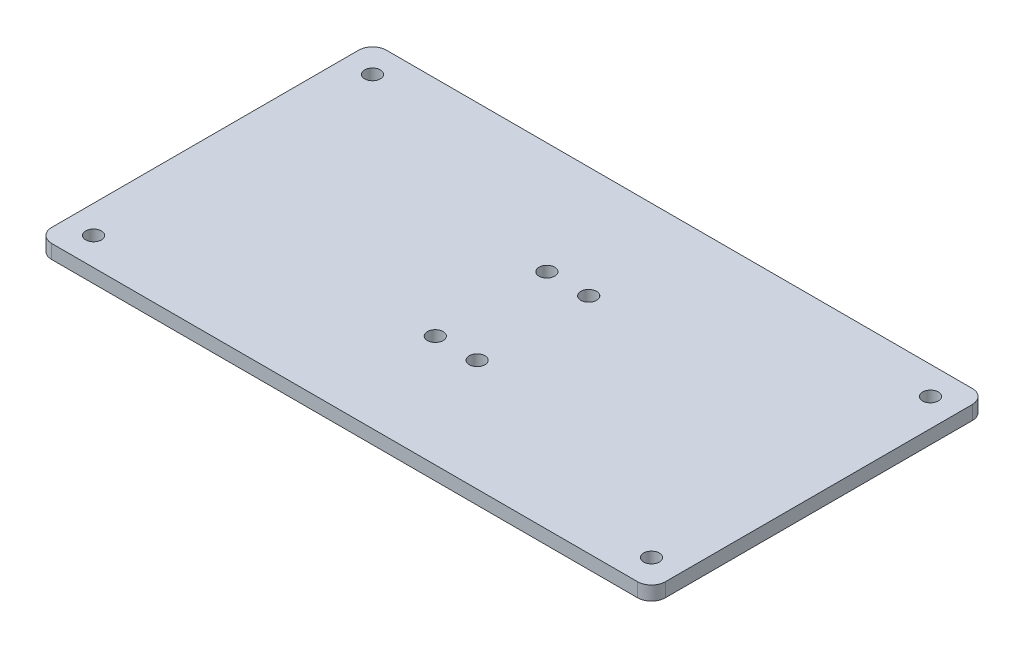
ISO-10303-21;
HEADER;
FILE_DESCRIPTION(('STEP AP214'),'2;1');
FILE_NAME('part.step','',(''),(''),'','','');
FILE_SCHEMA(('AUTOMOTIVE_DESIGN { 1 0 10303 214 1 1 1 1 }'));
ENDSEC;
DATA;
#1=APPLICATION_CONTEXT('core data for automotive mechanical design processes');
#2=APPLICATION_PROTOCOL_DEFINITION('international standard','automotive_design',2000,#1);
#3=PRODUCT_CONTEXT('',#1,'mechanical');
#4=PRODUCT('Part','Part','',(#3));
#5=PRODUCT_RELATED_PRODUCT_CATEGORY('part','',(#4));
#6=PRODUCT_DEFINITION_FORMATION('','',#4);
#7=PRODUCT_DEFINITION_CONTEXT('part definition',#1,'design');
#8=PRODUCT_DEFINITION('design','',#6,#7);
#9=PRODUCT_DEFINITION_SHAPE('','',#8);
#10=(LENGTH_UNIT() NAMED_UNIT(*) SI_UNIT(.MILLI.,.METRE.));
#11=(NAMED_UNIT(*) PLANE_ANGLE_UNIT() SI_UNIT($,.RADIAN.));
#12=(NAMED_UNIT(*) SI_UNIT($,.STERADIAN.) SOLID_ANGLE_UNIT());
#13=UNCERTAINTY_MEASURE_WITH_UNIT(LENGTH_MEASURE(1.E-05),#10,'distance_accuracy_value','');
#14=(GEOMETRIC_REPRESENTATION_CONTEXT(3) GLOBAL_UNCERTAINTY_ASSIGNED_CONTEXT((#13)) GLOBAL_UNIT_ASSIGNED_CONTEXT((#10,
#11,#12)) REPRESENTATION_CONTEXT('',''));
#15=CARTESIAN_POINT('',(0.,0.,0.));
#16=DIRECTION('',(0.,0.,1.));
#17=DIRECTION('',(1.,0.,0.));
#18=AXIS2_PLACEMENT_3D('',#15,#16,#17);
#19=CARTESIAN_POINT('',(0.,6.35,0.));
#20=DIRECTION('',(0.,-1.,0.));
#21=DIRECTION('',(0.,0.,-1.));
#22=AXIS2_PLACEMENT_3D('',#19,#20,#21);
#23=PLANE('',#22);
#24=DIRECTION('',(0.,0.,-1.));
#25=VECTOR('',#24,1.);
#26=CARTESIAN_POINT('',(139.7,6.35,76.2));
#27=LINE('',#26,#25);
#28=CARTESIAN_POINT('',(139.7,6.35,69.85));
#29=VERTEX_POINT('',#28);
#30=CARTESIAN_POINT('',(139.7,6.35,-69.85));
#31=VERTEX_POINT('',#30);
#32=EDGE_CURVE('E152',#29,#31,#27,.T.);
#33=ORIENTED_EDGE('',*,*,#32,.T.);
#34=CARTESIAN_POINT('',(133.35,6.35,-69.85));
#35=DIRECTION('',(0.,-1.,0.));
#36=DIRECTION('',(0.,0.,-1.));
#37=AXIS2_PLACEMENT_3D('',#34,#35,#36);
#38=CIRCLE('',#37,6.35);
#39=CARTESIAN_POINT('',(133.35,6.35,-76.2));
#40=VERTEX_POINT('',#39);
#41=EDGE_CURVE('E175',#31,#40,#38,.F.);
#42=ORIENTED_EDGE('',*,*,#41,.T.);
#43=DIRECTION('',(-1.,0.,0.));
#44=VECTOR('',#43,1.);
#45=CARTESIAN_POINT('',(-139.7,6.35,-76.2));
#46=LINE('',#45,#44);
#47=CARTESIAN_POINT('',(-133.35,6.35,-76.2));
#48=VERTEX_POINT('',#47);
#49=EDGE_CURVE('E128',#40,#48,#46,.T.);
#50=ORIENTED_EDGE('',*,*,#49,.T.);
#51=CARTESIAN_POINT('',(-133.35,6.35,-69.85));
#52=DIRECTION('',(0.,-1.,0.));
#53=DIRECTION('',(0.,0.,-1.));
#54=AXIS2_PLACEMENT_3D('',#51,#52,#53);
#55=CIRCLE('',#54,6.35);
#56=CARTESIAN_POINT('',(-139.7,6.35,-69.85));
#57=VERTEX_POINT('',#56);
#58=EDGE_CURVE('E169',#48,#57,#55,.F.);
#59=ORIENTED_EDGE('',*,*,#58,.T.);
#60=DIRECTION('',(0.,0.,1.));
#61=VECTOR('',#60,1.);
#62=CARTESIAN_POINT('',(-139.7,6.35,76.2));
#63=LINE('',#62,#61);
#64=CARTESIAN_POINT('',(-139.7,6.35,69.85));
#65=VERTEX_POINT('',#64);
#66=EDGE_CURVE('E188',#57,#65,#63,.T.);
#67=ORIENTED_EDGE('',*,*,#66,.T.);
#68=CARTESIAN_POINT('',(-133.35,6.35,69.85));
#69=DIRECTION('',(0.,-1.,0.));
#70=DIRECTION('',(0.,0.,-1.));
#71=AXIS2_PLACEMENT_3D('',#68,#69,#70);
#72=CIRCLE('',#71,6.35);
#73=CARTESIAN_POINT('',(-133.35,6.35,76.2));
#74=VERTEX_POINT('',#73);
#75=EDGE_CURVE('E62',#65,#74,#72,.F.);
#76=ORIENTED_EDGE('',*,*,#75,.T.);
#77=DIRECTION('',(1.,0.,0.));
#78=VECTOR('',#77,1.);
#79=CARTESIAN_POINT('',(-139.7,6.35,76.2));
#80=LINE('',#79,#78);
#81=CARTESIAN_POINT('',(133.35,6.35,76.2));
#82=VERTEX_POINT('',#81);
#83=EDGE_CURVE('E154',#74,#82,#80,.T.);
#84=ORIENTED_EDGE('',*,*,#83,.T.);
#85=CARTESIAN_POINT('',(133.35,6.35,69.85));
#86=DIRECTION('',(0.,-1.,0.));
#87=DIRECTION('',(0.,0.,-1.));
#88=AXIS2_PLACEMENT_3D('',#85,#86,#87);
#89=CIRCLE('',#88,6.35);
#90=EDGE_CURVE('E172',#82,#29,#89,.F.);
#91=ORIENTED_EDGE('',*,*,#90,.T.);
#92=EDGE_LOOP('',(#33,#42,#50,#59,#67,#76,#84,#91));
#93=FACE_BOUND('',#92,.T.);
#94=CARTESIAN_POINT('',(9.52500000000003,6.35,-25.4));
#95=DIRECTION('',(0.,1.,0.));
#96=DIRECTION('',(0.,0.,1.));
#97=AXIS2_PLACEMENT_3D('',#94,#95,#96);
#98=CIRCLE('',#97,3.571875);
#99=CARTESIAN_POINT('',(9.52500000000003,6.35,-21.828125));
#100=VERTEX_POINT('',#99);
#101=EDGE_CURVE('E146',#100,#100,#98,.T.);
#102=ORIENTED_EDGE('',*,*,#101,.F.);
#103=EDGE_LOOP('',(#102));
#104=FACE_BOUND('',#103,.T.);
#105=CARTESIAN_POINT('',(-9.52499999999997,6.35,-25.4));
#106=DIRECTION('',(0.,1.,0.));
#107=DIRECTION('',(0.,0.,1.));
#108=AXIS2_PLACEMENT_3D('',#105,#106,#107);
#109=CIRCLE('',#108,3.571875);
#110=CARTESIAN_POINT('',(-9.52499999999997,6.35,-21.828125));
#111=VERTEX_POINT('',#110);
#112=EDGE_CURVE('E216',#111,#111,#109,.T.);
#113=ORIENTED_EDGE('',*,*,#112,.F.);
#114=EDGE_LOOP('',(#113));
#115=FACE_BOUND('',#114,.T.);
#116=CARTESIAN_POINT('',(-9.52499999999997,6.35,25.4));
#117=DIRECTION('',(0.,1.,0.));
#118=DIRECTION('',(0.,0.,1.));
#119=AXIS2_PLACEMENT_3D('',#116,#117,#118);
#120=CIRCLE('',#119,3.571875);
#121=CARTESIAN_POINT('',(-9.52499999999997,6.35,28.971875));
#122=VERTEX_POINT('',#121);
#123=EDGE_CURVE('E224',#122,#122,#120,.T.);
#124=ORIENTED_EDGE('',*,*,#123,.F.);
#125=EDGE_LOOP('',(#124));
#126=FACE_BOUND('',#125,.T.);
#127=CARTESIAN_POINT('',(9.52500000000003,6.35,25.4));
#128=DIRECTION('',(0.,1.,0.));
#129=DIRECTION('',(0.,0.,1.));
#130=AXIS2_PLACEMENT_3D('',#127,#128,#129);
#131=CIRCLE('',#130,3.571875);
#132=CARTESIAN_POINT('',(9.52500000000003,6.35,28.971875));
#133=VERTEX_POINT('',#132);
#134=EDGE_CURVE('E232',#133,#133,#131,.T.);
#135=ORIENTED_EDGE('',*,*,#134,.F.);
#136=EDGE_LOOP('',(#135));
#137=FACE_BOUND('',#136,.T.);
#138=CARTESIAN_POINT('',(-127.,6.35,-63.5));
#139=DIRECTION('',(0.,1.,0.));
#140=DIRECTION('',(0.,0.,1.));
#141=AXIS2_PLACEMENT_3D('',#138,#139,#140);
#142=CIRCLE('',#141,3.57187500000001);
#143=CARTESIAN_POINT('',(-127.,6.35,-59.928125));
#144=VERTEX_POINT('',#143);
#145=EDGE_CURVE('E240',#144,#144,#142,.T.);
#146=ORIENTED_EDGE('',*,*,#145,.F.);
#147=EDGE_LOOP('',(#146));
#148=FACE_BOUND('',#147,.T.);
#149=CARTESIAN_POINT('',(127.,6.35,-63.5));
#150=DIRECTION('',(0.,1.,0.));
#151=DIRECTION('',(0.,0.,1.));
#152=AXIS2_PLACEMENT_3D('',#149,#150,#151);
#153=CIRCLE('',#152,3.57187500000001);
#154=CARTESIAN_POINT('',(127.,6.35,-59.928125));
#155=VERTEX_POINT('',#154);
#156=EDGE_CURVE('E248',#155,#155,#153,.T.);
#157=ORIENTED_EDGE('',*,*,#156,.F.);
#158=EDGE_LOOP('',(#157));
#159=FACE_BOUND('',#158,.T.);
#160=CARTESIAN_POINT('',(127.,6.35,63.5));
#161=DIRECTION('',(0.,1.,0.));
#162=DIRECTION('',(0.,0.,1.));
#163=AXIS2_PLACEMENT_3D('',#160,#161,#162);
#164=CIRCLE('',#163,3.57187500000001);
#165=CARTESIAN_POINT('',(127.,6.35,67.071875));
#166=VERTEX_POINT('',#165);
#167=EDGE_CURVE('E256',#166,#166,#164,.T.);
#168=ORIENTED_EDGE('',*,*,#167,.F.);
#169=EDGE_LOOP('',(#168));
#170=FACE_BOUND('',#169,.T.);
#171=CARTESIAN_POINT('',(-127.,6.35,63.5));
#172=DIRECTION('',(0.,1.,0.));
#173=DIRECTION('',(0.,0.,1.));
#174=AXIS2_PLACEMENT_3D('',#171,#172,#173);
#175=CIRCLE('',#174,3.57187500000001);
#176=CARTESIAN_POINT('',(-127.,6.35,67.071875));
#177=VERTEX_POINT('',#176);
#178=EDGE_CURVE('E264',#177,#177,#175,.T.);
#179=ORIENTED_EDGE('',*,*,#178,.F.);
#180=EDGE_LOOP('',(#179));
#181=FACE_BOUND('',#180,.T.);
#182=ADVANCED_FACE('F39',(#93,#104,#115,#126,#137,#148,#159,#170,#181),#23,.F.);
#183=CARTESIAN_POINT('',(0.,0.,0.));
#184=DIRECTION('',(0.,-1.,0.));
#185=DIRECTION('',(0.,0.,-1.));
#186=AXIS2_PLACEMENT_3D('',#183,#184,#185);
#187=PLANE('',#186);
#188=CARTESIAN_POINT('',(127.,0.,63.5));
#189=DIRECTION('',(0.,1.,0.));
#190=DIRECTION('',(0.,0.,1.));
#191=AXIS2_PLACEMENT_3D('',#188,#189,#190);
#192=CIRCLE('',#191,3.57187500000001);
#193=CARTESIAN_POINT('',(127.,0.,67.071875));
#194=VERTEX_POINT('',#193);
#195=EDGE_CURVE('E260',#194,#194,#192,.T.);
#196=ORIENTED_EDGE('',*,*,#195,.T.);
#197=EDGE_LOOP('',(#196));
#198=FACE_BOUND('',#197,.T.);
#199=CARTESIAN_POINT('',(-127.,0.,-63.5));
#200=DIRECTION('',(0.,1.,0.));
#201=DIRECTION('',(0.,0.,1.));
#202=AXIS2_PLACEMENT_3D('',#199,#200,#201);
#203=CIRCLE('',#202,3.57187500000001);
#204=CARTESIAN_POINT('',(-127.,0.,-59.928125));
#205=VERTEX_POINT('',#204);
#206=EDGE_CURVE('E244',#205,#205,#203,.T.);
#207=ORIENTED_EDGE('',*,*,#206,.T.);
#208=EDGE_LOOP('',(#207));
#209=FACE_BOUND('',#208,.T.);
#210=CARTESIAN_POINT('',(-9.52499999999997,0.,25.4));
#211=DIRECTION('',(0.,1.,0.));
#212=DIRECTION('',(0.,0.,1.));
#213=AXIS2_PLACEMENT_3D('',#210,#211,#212);
#214=CIRCLE('',#213,3.571875);
#215=CARTESIAN_POINT('',(-9.52499999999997,0.,28.971875));
#216=VERTEX_POINT('',#215);
#217=EDGE_CURVE('E228',#216,#216,#214,.T.);
#218=ORIENTED_EDGE('',*,*,#217,.T.);
#219=EDGE_LOOP('',(#218));
#220=FACE_BOUND('',#219,.T.);
#221=CARTESIAN_POINT('',(9.52500000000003,0.,-25.4));
#222=DIRECTION('',(0.,1.,0.));
#223=DIRECTION('',(0.,0.,1.));
#224=AXIS2_PLACEMENT_3D('',#221,#222,#223);
#225=CIRCLE('',#224,3.571875);
#226=CARTESIAN_POINT('',(9.52500000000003,0.,-21.828125));
#227=VERTEX_POINT('',#226);
#228=EDGE_CURVE('E211',#227,#227,#225,.T.);
#229=ORIENTED_EDGE('',*,*,#228,.T.);
#230=EDGE_LOOP('',(#229));
#231=FACE_BOUND('',#230,.T.);
#232=DIRECTION('',(-1.,0.,0.));
#233=VECTOR('',#232,1.);
#234=CARTESIAN_POINT('',(-139.7,0.,-76.2));
#235=LINE('',#234,#233);
#236=CARTESIAN_POINT('',(133.35,0.,-76.2));
#237=VERTEX_POINT('',#236);
#238=CARTESIAN_POINT('',(-133.35,0.,-76.2));
#239=VERTEX_POINT('',#238);
#240=EDGE_CURVE('E125',#237,#239,#235,.T.);
#241=ORIENTED_EDGE('',*,*,#240,.F.);
#242=CARTESIAN_POINT('',(133.35,0.,-69.85));
#243=DIRECTION('',(0.,-1.,0.));
#244=DIRECTION('',(0.,0.,-1.));
#245=AXIS2_PLACEMENT_3D('',#242,#243,#244);
#246=CIRCLE('',#245,6.35);
#247=CARTESIAN_POINT('',(139.7,0.,-69.85));
#248=VERTEX_POINT('',#247);
#249=EDGE_CURVE('E107',#237,#248,#246,.T.);
#250=ORIENTED_EDGE('',*,*,#249,.T.);
#251=DIRECTION('',(0.,0.,-1.));
#252=VECTOR('',#251,1.);
#253=CARTESIAN_POINT('',(139.7,0.,76.2));
#254=LINE('',#253,#252);
#255=CARTESIAN_POINT('',(139.7,0.,69.85));
#256=VERTEX_POINT('',#255);
#257=EDGE_CURVE('E139',#256,#248,#254,.T.);
#258=ORIENTED_EDGE('',*,*,#257,.F.);
#259=CARTESIAN_POINT('',(133.35,0.,69.85));
#260=DIRECTION('',(0.,-1.,0.));
#261=DIRECTION('',(0.,0.,-1.));
#262=AXIS2_PLACEMENT_3D('',#259,#260,#261);
#263=CIRCLE('',#262,6.35);
#264=CARTESIAN_POINT('',(133.35,0.,76.2));
#265=VERTEX_POINT('',#264);
#266=EDGE_CURVE('E119',#256,#265,#263,.T.);
#267=ORIENTED_EDGE('',*,*,#266,.T.);
#268=DIRECTION('',(1.,0.,0.));
#269=VECTOR('',#268,1.);
#270=CARTESIAN_POINT('',(-139.7,0.,76.2));
#271=LINE('',#270,#269);
#272=CARTESIAN_POINT('',(-133.35,0.,76.2));
#273=VERTEX_POINT('',#272);
#274=EDGE_CURVE('E144',#273,#265,#271,.T.);
#275=ORIENTED_EDGE('',*,*,#274,.F.);
#276=CARTESIAN_POINT('',(-133.35,0.,69.85));
#277=DIRECTION('',(0.,-1.,0.));
#278=DIRECTION('',(0.,0.,-1.));
#279=AXIS2_PLACEMENT_3D('',#276,#277,#278);
#280=CIRCLE('',#279,6.35);
#281=CARTESIAN_POINT('',(-139.7,0.,69.85));
#282=VERTEX_POINT('',#281);
#283=EDGE_CURVE('E130',#273,#282,#280,.T.);
#284=ORIENTED_EDGE('',*,*,#283,.T.);
#285=DIRECTION('',(0.,0.,1.));
#286=VECTOR('',#285,1.);
#287=CARTESIAN_POINT('',(-139.7,0.,76.2));
#288=LINE('',#287,#286);
#289=CARTESIAN_POINT('',(-139.7,0.,-69.85));
#290=VERTEX_POINT('',#289);
#291=EDGE_CURVE('E138',#290,#282,#288,.T.);
#292=ORIENTED_EDGE('',*,*,#291,.F.);
#293=CARTESIAN_POINT('',(-133.35,0.,-69.85));
#294=DIRECTION('',(0.,-1.,0.));
#295=DIRECTION('',(0.,0.,-1.));
#296=AXIS2_PLACEMENT_3D('',#293,#294,#295);
#297=CIRCLE('',#296,6.35);
#298=EDGE_CURVE('E136',#290,#239,#297,.T.);
#299=ORIENTED_EDGE('',*,*,#298,.T.);
#300=EDGE_LOOP('',(#241,#250,#258,#267,#275,#284,#292,#299));
#301=FACE_BOUND('',#300,.T.);
#302=CARTESIAN_POINT('',(-9.52499999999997,0.,-25.4));
#303=DIRECTION('',(0.,1.,0.));
#304=DIRECTION('',(0.,0.,1.));
#305=AXIS2_PLACEMENT_3D('',#302,#303,#304);
#306=CIRCLE('',#305,3.571875);
#307=CARTESIAN_POINT('',(-9.52499999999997,0.,-21.828125));
#308=VERTEX_POINT('',#307);
#309=EDGE_CURVE('E220',#308,#308,#306,.T.);
#310=ORIENTED_EDGE('',*,*,#309,.T.);
#311=EDGE_LOOP('',(#310));
#312=FACE_BOUND('',#311,.T.);
#313=CARTESIAN_POINT('',(9.52500000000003,0.,25.4));
#314=DIRECTION('',(0.,1.,0.));
#315=DIRECTION('',(0.,0.,1.));
#316=AXIS2_PLACEMENT_3D('',#313,#314,#315);
#317=CIRCLE('',#316,3.571875);
#318=CARTESIAN_POINT('',(9.52500000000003,0.,28.971875));
#319=VERTEX_POINT('',#318);
#320=EDGE_CURVE('E236',#319,#319,#317,.T.);
#321=ORIENTED_EDGE('',*,*,#320,.T.);
#322=EDGE_LOOP('',(#321));
#323=FACE_BOUND('',#322,.T.);
#324=CARTESIAN_POINT('',(127.,0.,-63.5));
#325=DIRECTION('',(0.,1.,0.));
#326=DIRECTION('',(0.,0.,1.));
#327=AXIS2_PLACEMENT_3D('',#324,#325,#326);
#328=CIRCLE('',#327,3.57187500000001);
#329=CARTESIAN_POINT('',(127.,0.,-59.928125));
#330=VERTEX_POINT('',#329);
#331=EDGE_CURVE('E252',#330,#330,#328,.T.);
#332=ORIENTED_EDGE('',*,*,#331,.T.);
#333=EDGE_LOOP('',(#332));
#334=FACE_BOUND('',#333,.T.);
#335=CARTESIAN_POINT('',(-127.,0.,63.5));
#336=DIRECTION('',(0.,1.,0.));
#337=DIRECTION('',(0.,0.,1.));
#338=AXIS2_PLACEMENT_3D('',#335,#336,#337);
#339=CIRCLE('',#338,3.57187500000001);
#340=CARTESIAN_POINT('',(-127.,0.,67.071875));
#341=VERTEX_POINT('',#340);
#342=EDGE_CURVE('E268',#341,#341,#339,.T.);
#343=ORIENTED_EDGE('',*,*,#342,.T.);
#344=EDGE_LOOP('',(#343));
#345=FACE_BOUND('',#344,.T.);
#346=ADVANCED_FACE('F133',(#198,#209,#220,#231,#301,#312,#323,#334,#345),#187,.T.);
#347=CARTESIAN_POINT('',(139.7,6.35,76.2));
#348=DIRECTION('',(-1.,0.,0.));
#349=DIRECTION('',(0.,0.,1.));
#350=AXIS2_PLACEMENT_3D('',#347,#348,#349);
#351=PLANE('',#350);
#352=ORIENTED_EDGE('',*,*,#257,.T.);
#353=DIRECTION('',(0.,-1.,0.));
#354=VECTOR('',#353,1.);
#355=CARTESIAN_POINT('',(139.7,6.35,-69.85));
#356=LINE('',#355,#354);
#357=EDGE_CURVE('E112',#248,#31,#356,.F.);
#358=ORIENTED_EDGE('',*,*,#357,.T.);
#359=ORIENTED_EDGE('',*,*,#32,.F.);
#360=DIRECTION('',(0.,-1.,0.));
#361=VECTOR('',#360,1.);
#362=CARTESIAN_POINT('',(139.7,6.35,69.85));
#363=LINE('',#362,#361);
#364=EDGE_CURVE('E118',#29,#256,#363,.T.);
#365=ORIENTED_EDGE('',*,*,#364,.T.);
#366=EDGE_LOOP('',(#352,#358,#359,#365));
#367=FACE_BOUND('',#366,.T.);
#368=ADVANCED_FACE('F205',(#367),#351,.F.);
#369=CARTESIAN_POINT('',(-139.7,6.35,-76.2));
#370=DIRECTION('',(0.,0.,1.));
#371=DIRECTION('',(1.,0.,0.));
#372=AXIS2_PLACEMENT_3D('',#369,#370,#371);
#373=PLANE('',#372);
#374=ORIENTED_EDGE('',*,*,#49,.F.);
#375=DIRECTION('',(0.,-1.,0.));
#376=VECTOR('',#375,1.);
#377=CARTESIAN_POINT('',(133.35,6.35,-76.2));
#378=LINE('',#377,#376);
#379=EDGE_CURVE('E111',#40,#237,#378,.T.);
#380=ORIENTED_EDGE('',*,*,#379,.T.);
#381=ORIENTED_EDGE('',*,*,#240,.T.);
#382=DIRECTION('',(0.,-1.,0.));
#383=VECTOR('',#382,1.);
#384=CARTESIAN_POINT('',(-133.35,6.35,-76.2));
#385=LINE('',#384,#383);
#386=EDGE_CURVE('E131',#239,#48,#385,.F.);
#387=ORIENTED_EDGE('',*,*,#386,.T.);
#388=EDGE_LOOP('',(#374,#380,#381,#387));
#389=FACE_BOUND('',#388,.T.);
#390=ADVANCED_FACE('F124',(#389),#373,.F.);
#391=CARTESIAN_POINT('',(-139.7,6.35,76.2));
#392=DIRECTION('',(1.,0.,0.));
#393=DIRECTION('',(0.,0.,-1.));
#394=AXIS2_PLACEMENT_3D('',#391,#392,#393);
#395=PLANE('',#394);
#396=ORIENTED_EDGE('',*,*,#66,.F.);
#397=DIRECTION('',(0.,-1.,0.));
#398=VECTOR('',#397,1.);
#399=CARTESIAN_POINT('',(-139.7,6.35,-69.85));
#400=LINE('',#399,#398);
#401=EDGE_CURVE('E11',#57,#290,#400,.T.);
#402=ORIENTED_EDGE('',*,*,#401,.T.);
#403=ORIENTED_EDGE('',*,*,#291,.T.);
#404=DIRECTION('',(0.,-1.,0.));
#405=VECTOR('',#404,1.);
#406=CARTESIAN_POINT('',(-139.7,6.35,69.85));
#407=LINE('',#406,#405);
#408=EDGE_CURVE('E48',#282,#65,#407,.F.);
#409=ORIENTED_EDGE('',*,*,#408,.T.);
#410=EDGE_LOOP('',(#396,#402,#403,#409));
#411=FACE_BOUND('',#410,.T.);
#412=ADVANCED_FACE('F187',(#411),#395,.F.);
#413=CARTESIAN_POINT('',(-139.7,6.35,76.2));
#414=DIRECTION('',(0.,0.,-1.));
#415=DIRECTION('',(-1.,0.,0.));
#416=AXIS2_PLACEMENT_3D('',#413,#414,#415);
#417=PLANE('',#416);
#418=ORIENTED_EDGE('',*,*,#274,.T.);
#419=DIRECTION('',(0.,-1.,0.));
#420=VECTOR('',#419,1.);
#421=CARTESIAN_POINT('',(133.35,6.35,76.2));
#422=LINE('',#421,#420);
#423=EDGE_CURVE('E55',#265,#82,#422,.F.);
#424=ORIENTED_EDGE('',*,*,#423,.T.);
#425=ORIENTED_EDGE('',*,*,#83,.F.);
#426=DIRECTION('',(0.,-1.,0.));
#427=VECTOR('',#426,1.);
#428=CARTESIAN_POINT('',(-133.35,6.35,76.2));
#429=LINE('',#428,#427);
#430=EDGE_CURVE('E178',#74,#273,#429,.T.);
#431=ORIENTED_EDGE('',*,*,#430,.T.);
#432=EDGE_LOOP('',(#418,#424,#425,#431));
#433=FACE_BOUND('',#432,.T.);
#434=ADVANCED_FACE('F198',(#433),#417,.F.);
#435=CARTESIAN_POINT('',(9.52500000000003,6.35,-25.4));
#436=DIRECTION('',(0.,-1.,0.));
#437=DIRECTION('',(0.,0.,-1.));
#438=AXIS2_PLACEMENT_3D('',#435,#436,#437);
#439=CYLINDRICAL_SURFACE('',#438,3.571875);
#440=ORIENTED_EDGE('',*,*,#101,.T.);
#441=EDGE_LOOP('',(#440));
#442=FACE_BOUND('',#441,.T.);
#443=ORIENTED_EDGE('',*,*,#228,.F.);
#444=EDGE_LOOP('',(#443));
#445=FACE_BOUND('',#444,.T.);
#446=ADVANCED_FACE('F287',(#442,#445),#439,.F.);
#447=CARTESIAN_POINT('',(-9.52499999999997,6.35,-25.4));
#448=DIRECTION('',(0.,-1.,0.));
#449=DIRECTION('',(0.,0.,-1.));
#450=AXIS2_PLACEMENT_3D('',#447,#448,#449);
#451=CYLINDRICAL_SURFACE('',#450,3.571875);
#452=ORIENTED_EDGE('',*,*,#112,.T.);
#453=EDGE_LOOP('',(#452));
#454=FACE_BOUND('',#453,.T.);
#455=ORIENTED_EDGE('',*,*,#309,.F.);
#456=EDGE_LOOP('',(#455));
#457=FACE_BOUND('',#456,.T.);
#458=ADVANCED_FACE('F419',(#454,#457),#451,.F.);
#459=CARTESIAN_POINT('',(-9.52499999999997,6.35,25.4));
#460=DIRECTION('',(0.,-1.,0.));
#461=DIRECTION('',(0.,0.,-1.));
#462=AXIS2_PLACEMENT_3D('',#459,#460,#461);
#463=CYLINDRICAL_SURFACE('',#462,3.571875);
#464=ORIENTED_EDGE('',*,*,#123,.T.);
#465=EDGE_LOOP('',(#464));
#466=FACE_BOUND('',#465,.T.);
#467=ORIENTED_EDGE('',*,*,#217,.F.);
#468=EDGE_LOOP('',(#467));
#469=FACE_BOUND('',#468,.T.);
#470=ADVANCED_FACE('F409',(#466,#469),#463,.F.);
#471=CARTESIAN_POINT('',(9.52500000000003,6.35,25.4));
#472=DIRECTION('',(0.,-1.,0.));
#473=DIRECTION('',(0.,0.,-1.));
#474=AXIS2_PLACEMENT_3D('',#471,#472,#473);
#475=CYLINDRICAL_SURFACE('',#474,3.571875);
#476=ORIENTED_EDGE('',*,*,#134,.T.);
#477=EDGE_LOOP('',(#476));
#478=FACE_BOUND('',#477,.T.);
#479=ORIENTED_EDGE('',*,*,#320,.F.);
#480=EDGE_LOOP('',(#479));
#481=FACE_BOUND('',#480,.T.);
#482=ADVANCED_FACE('F399',(#478,#481),#475,.F.);
#483=CARTESIAN_POINT('',(-127.,6.35,-63.5));
#484=DIRECTION('',(0.,-1.,0.));
#485=DIRECTION('',(0.,0.,-1.));
#486=AXIS2_PLACEMENT_3D('',#483,#484,#485);
#487=CYLINDRICAL_SURFACE('',#486,3.57187500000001);
#488=ORIENTED_EDGE('',*,*,#145,.T.);
#489=EDGE_LOOP('',(#488));
#490=FACE_BOUND('',#489,.T.);
#491=ORIENTED_EDGE('',*,*,#206,.F.);
#492=EDGE_LOOP('',(#491));
#493=FACE_BOUND('',#492,.T.);
#494=ADVANCED_FACE('F389',(#490,#493),#487,.F.);
#495=CARTESIAN_POINT('',(127.,6.35,-63.5));
#496=DIRECTION('',(0.,-1.,0.));
#497=DIRECTION('',(0.,0.,-1.));
#498=AXIS2_PLACEMENT_3D('',#495,#496,#497);
#499=CYLINDRICAL_SURFACE('',#498,3.57187500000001);
#500=ORIENTED_EDGE('',*,*,#156,.T.);
#501=EDGE_LOOP('',(#500));
#502=FACE_BOUND('',#501,.T.);
#503=ORIENTED_EDGE('',*,*,#331,.F.);
#504=EDGE_LOOP('',(#503));
#505=FACE_BOUND('',#504,.T.);
#506=ADVANCED_FACE('F379',(#502,#505),#499,.F.);
#507=CARTESIAN_POINT('',(127.,6.35,63.5));
#508=DIRECTION('',(0.,-1.,0.));
#509=DIRECTION('',(0.,0.,-1.));
#510=AXIS2_PLACEMENT_3D('',#507,#508,#509);
#511=CYLINDRICAL_SURFACE('',#510,3.57187500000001);
#512=ORIENTED_EDGE('',*,*,#167,.T.);
#513=EDGE_LOOP('',(#512));
#514=FACE_BOUND('',#513,.T.);
#515=ORIENTED_EDGE('',*,*,#195,.F.);
#516=EDGE_LOOP('',(#515));
#517=FACE_BOUND('',#516,.T.);
#518=ADVANCED_FACE('F370',(#514,#517),#511,.F.);
#519=CARTESIAN_POINT('',(-127.,6.35,63.5));
#520=DIRECTION('',(0.,-1.,0.));
#521=DIRECTION('',(0.,0.,-1.));
#522=AXIS2_PLACEMENT_3D('',#519,#520,#521);
#523=CYLINDRICAL_SURFACE('',#522,3.57187500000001);
#524=ORIENTED_EDGE('',*,*,#178,.T.);
#525=EDGE_LOOP('',(#524));
#526=FACE_BOUND('',#525,.T.);
#527=ORIENTED_EDGE('',*,*,#342,.F.);
#528=EDGE_LOOP('',(#527));
#529=FACE_BOUND('',#528,.T.);
#530=ADVANCED_FACE('F276',(#526,#529),#523,.F.);
#531=CARTESIAN_POINT('',(133.35,6.35,-69.85));
#532=DIRECTION('',(0.,-1.,0.));
#533=DIRECTION('',(0.,0.,-1.));
#534=AXIS2_PLACEMENT_3D('',#531,#532,#533);
#535=CYLINDRICAL_SURFACE('',#534,6.35);
#536=ORIENTED_EDGE('',*,*,#41,.F.);
#537=ORIENTED_EDGE('',*,*,#357,.F.);
#538=ORIENTED_EDGE('',*,*,#249,.F.);
#539=ORIENTED_EDGE('',*,*,#379,.F.);
#540=EDGE_LOOP('',(#536,#537,#538,#539));
#541=FACE_BOUND('',#540,.T.);
#542=ADVANCED_FACE('F110',(#541),#535,.T.);
#543=CARTESIAN_POINT('',(133.35,6.35,69.85));
#544=DIRECTION('',(0.,-1.,0.));
#545=DIRECTION('',(0.,0.,-1.));
#546=AXIS2_PLACEMENT_3D('',#543,#544,#545);
#547=CYLINDRICAL_SURFACE('',#546,6.35);
#548=ORIENTED_EDGE('',*,*,#90,.F.);
#549=ORIENTED_EDGE('',*,*,#423,.F.);
#550=ORIENTED_EDGE('',*,*,#266,.F.);
#551=ORIENTED_EDGE('',*,*,#364,.F.);
#552=EDGE_LOOP('',(#548,#549,#550,#551));
#553=FACE_BOUND('',#552,.T.);
#554=ADVANCED_FACE('F202',(#553),#547,.T.);
#555=CARTESIAN_POINT('',(-133.35,6.35,-69.85));
#556=DIRECTION('',(0.,-1.,0.));
#557=DIRECTION('',(0.,0.,-1.));
#558=AXIS2_PLACEMENT_3D('',#555,#556,#557);
#559=CYLINDRICAL_SURFACE('',#558,6.35);
#560=ORIENTED_EDGE('',*,*,#58,.F.);
#561=ORIENTED_EDGE('',*,*,#386,.F.);
#562=ORIENTED_EDGE('',*,*,#298,.F.);
#563=ORIENTED_EDGE('',*,*,#401,.F.);
#564=EDGE_LOOP('',(#560,#561,#562,#563));
#565=FACE_BOUND('',#564,.T.);
#566=ADVANCED_FACE('F301',(#565),#559,.T.);
#567=CARTESIAN_POINT('',(-133.35,6.35,69.85));
#568=DIRECTION('',(0.,-1.,0.));
#569=DIRECTION('',(0.,0.,-1.));
#570=AXIS2_PLACEMENT_3D('',#567,#568,#569);
#571=CYLINDRICAL_SURFACE('',#570,6.35);
#572=ORIENTED_EDGE('',*,*,#75,.F.);
#573=ORIENTED_EDGE('',*,*,#408,.F.);
#574=ORIENTED_EDGE('',*,*,#283,.F.);
#575=ORIENTED_EDGE('',*,*,#430,.F.);
#576=EDGE_LOOP('',(#572,#573,#574,#575));
#577=FACE_BOUND('',#576,.T.);
#578=ADVANCED_FACE('F41',(#577),#571,.T.);
#579=CLOSED_SHELL('',(#182,#346,#368,#390,#412,#434,#446,#458,#470,#482,#494,#506,#518,#530,
#542,#554,#566,#578));
#580=MANIFOLD_SOLID_BREP('B2',#579);
#581=ADVANCED_BREP_SHAPE_REPRESENTATION('',(#18,#580),#14);
#582=SHAPE_DEFINITION_REPRESENTATION(#9,#581);
ENDSEC;
END-ISO-10303-21;
